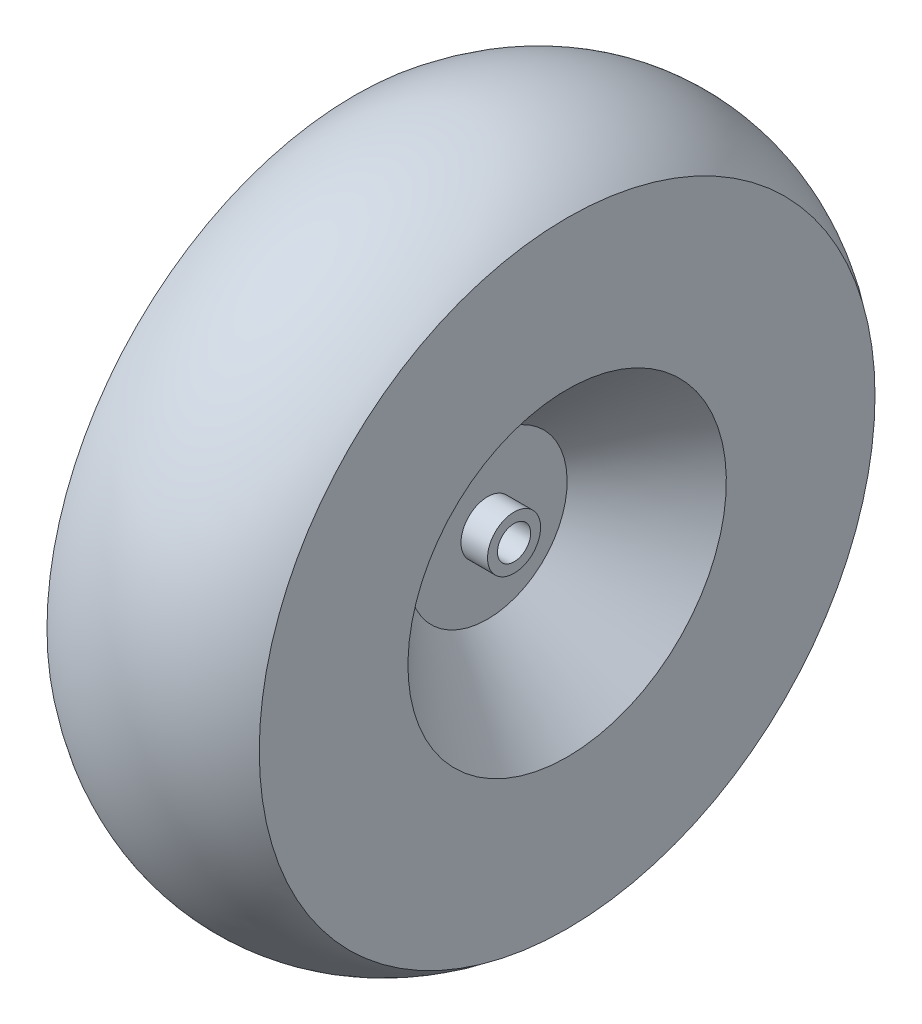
ISO-10303-21;
HEADER;
FILE_DESCRIPTION(('STEP AP214'),'2;1');
FILE_NAME('part.step','',(''),(''),'','','');
FILE_SCHEMA(('AUTOMOTIVE_DESIGN { 1 0 10303 214 1 1 1 1 }'));
ENDSEC;
DATA;
#1=APPLICATION_CONTEXT('core data for automotive mechanical design processes');
#2=APPLICATION_PROTOCOL_DEFINITION('international standard','automotive_design',2000,#1);
#3=PRODUCT_CONTEXT('',#1,'mechanical');
#4=PRODUCT('Part','Part','',(#3));
#5=PRODUCT_RELATED_PRODUCT_CATEGORY('part','',(#4));
#6=PRODUCT_DEFINITION_FORMATION('','',#4);
#7=PRODUCT_DEFINITION_CONTEXT('part definition',#1,'design');
#8=PRODUCT_DEFINITION('design','',#6,#7);
#9=PRODUCT_DEFINITION_SHAPE('','',#8);
#10=(LENGTH_UNIT() NAMED_UNIT(*) SI_UNIT(.MILLI.,.METRE.));
#11=(NAMED_UNIT(*) PLANE_ANGLE_UNIT() SI_UNIT($,.RADIAN.));
#12=(NAMED_UNIT(*) SI_UNIT($,.STERADIAN.) SOLID_ANGLE_UNIT());
#13=UNCERTAINTY_MEASURE_WITH_UNIT(LENGTH_MEASURE(1.E-05),#10,'distance_accuracy_value','');
#14=(GEOMETRIC_REPRESENTATION_CONTEXT(3) GLOBAL_UNCERTAINTY_ASSIGNED_CONTEXT((#13)) GLOBAL_UNIT_ASSIGNED_CONTEXT((#10,
#11,#12)) REPRESENTATION_CONTEXT('',''));
#15=CARTESIAN_POINT('',(0.,0.,0.));
#16=DIRECTION('',(0.,0.,1.));
#17=DIRECTION('',(1.,0.,0.));
#18=AXIS2_PLACEMENT_3D('',#15,#16,#17);
#19=CARTESIAN_POINT('',(50.8,0.,0.));
#20=DIRECTION('',(-1.,0.,0.));
#21=DIRECTION('',(0.,-1.,0.));
#22=AXIS2_PLACEMENT_3D('',#19,#20,#21);
#23=PLANE('',#22);
#24=CARTESIAN_POINT('',(50.8,0.,0.));
#25=DIRECTION('',(-1.,0.,0.));
#26=DIRECTION('',(0.,-1.,0.));
#27=AXIS2_PLACEMENT_3D('',#24,#25,#26);
#28=CIRCLE('',#27,147.358651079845);
#29=CARTESIAN_POINT('',(50.8,-147.358651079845,0.));
#30=VERTEX_POINT('',#29);
#31=EDGE_CURVE('E10',#30,#30,#28,.T.);
#32=ORIENTED_EDGE('',*,*,#31,.F.);
#33=EDGE_LOOP('',(#32));
#34=FACE_BOUND('',#33,.T.);
#35=CARTESIAN_POINT('',(50.8,0.,0.));
#36=DIRECTION('',(-1.,0.,0.));
#37=DIRECTION('',(0.,-1.,0.));
#38=AXIS2_PLACEMENT_3D('',#35,#36,#37);
#39=CIRCLE('',#38,76.2);
#40=CARTESIAN_POINT('',(50.8,-76.2,0.));
#41=VERTEX_POINT('',#40);
#42=EDGE_CURVE('E97',#41,#41,#39,.T.);
#43=ORIENTED_EDGE('',*,*,#42,.T.);
#44=EDGE_LOOP('',(#43));
#45=FACE_BOUND('',#44,.T.);
#46=ADVANCED_FACE('F46',(#34,#45),#23,.F.);
#47=CARTESIAN_POINT('',(0.,79.5701073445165,0.));
#48=DIRECTION('',(0.,0.,1.));
#49=DIRECTION('',(0.,-1.,0.));
#50=AXIS2_PLACEMENT_3D('',#47,#48,#49);
#51=ELLIPSE('',#50,85.5298926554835,83.3088481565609);
#52=TRIMMED_CURVE('',#51,(PARAMETER_VALUE(0.375513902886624)),
(PARAMETER_VALUE(5.90767140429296)),.T.,.PARAMETER.);
#53=CARTESIAN_POINT('',(-25.4,0.,0.));
#54=DIRECTION('',(-1.,0.,0.));
#55=AXIS1_PLACEMENT('',#53,#54);
#56=SURFACE_OF_REVOLUTION('',#52,#55);
#57=CARTESIAN_POINT('',(-50.8,0.,0.));
#58=DIRECTION('',(-1.,0.,0.));
#59=DIRECTION('',(0.,-1.,0.));
#60=AXIS2_PLACEMENT_3D('',#57,#58,#59);
#61=CIRCLE('',#60,147.358651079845);
#62=CARTESIAN_POINT('',(-50.7999999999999,-147.358651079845,0.));
#63=VERTEX_POINT('',#62);
#64=EDGE_CURVE('E53',#63,#63,#61,.T.);
#65=ORIENTED_EDGE('',*,*,#64,.F.);
#66=EDGE_LOOP('',(#65));
#67=FACE_BOUND('',#66,.T.);
#68=ORIENTED_EDGE('',*,*,#31,.T.);
#69=EDGE_LOOP('',(#68));
#70=FACE_BOUND('',#69,.T.);
#71=ADVANCED_FACE('F102',(#67,#70),#56,.T.);
#72=CARTESIAN_POINT('',(-50.8,0.,0.));
#73=DIRECTION('',(-1.,0.,0.));
#74=DIRECTION('',(0.,-1.,0.));
#75=AXIS2_PLACEMENT_3D('',#72,#73,#74);
#76=PLANE('',#75);
#77=ORIENTED_EDGE('',*,*,#64,.T.);
#78=EDGE_LOOP('',(#77));
#79=FACE_BOUND('',#78,.T.);
#80=CARTESIAN_POINT('',(-50.8,0.,0.));
#81=DIRECTION('',(-1.,0.,0.));
#82=DIRECTION('',(0.,-1.,0.));
#83=AXIS2_PLACEMENT_3D('',#80,#81,#82);
#84=CIRCLE('',#83,76.2);
#85=CARTESIAN_POINT('',(-50.8,-76.2,0.));
#86=VERTEX_POINT('',#85);
#87=EDGE_CURVE('E58',#86,#86,#84,.T.);
#88=ORIENTED_EDGE('',*,*,#87,.F.);
#89=EDGE_LOOP('',(#88));
#90=FACE_BOUND('',#89,.T.);
#91=ADVANCED_FACE('F105',(#79,#90),#76,.T.);
#92=CARTESIAN_POINT('',(-12.7,0.,0.));
#93=DIRECTION('',(-1.,0.,0.));
#94=DIRECTION('',(0.,-1.,0.));
#95=AXIS2_PLACEMENT_3D('',#92,#93,#94);
#96=CONICAL_SURFACE('',#95,38.0999999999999,0.78539816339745);
#97=ORIENTED_EDGE('',*,*,#87,.T.);
#98=EDGE_LOOP('',(#97));
#99=FACE_BOUND('',#98,.T.);
#100=CARTESIAN_POINT('',(-12.7,0.,0.));
#101=DIRECTION('',(-1.,0.,0.));
#102=DIRECTION('',(0.,-1.,0.));
#103=AXIS2_PLACEMENT_3D('',#100,#101,#102);
#104=CIRCLE('',#103,38.0999999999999);
#105=CARTESIAN_POINT('',(-12.7,-38.0999999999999,0.));
#106=VERTEX_POINT('',#105);
#107=EDGE_CURVE('E63',#106,#106,#104,.T.);
#108=ORIENTED_EDGE('',*,*,#107,.F.);
#109=EDGE_LOOP('',(#108));
#110=FACE_BOUND('',#109,.T.);
#111=ADVANCED_FACE('F109',(#99,#110),#96,.F.);
#112=CARTESIAN_POINT('',(-12.7,0.,0.));
#113=DIRECTION('',(-1.,0.,0.));
#114=DIRECTION('',(0.,-1.,0.));
#115=AXIS2_PLACEMENT_3D('',#112,#113,#114);
#116=PLANE('',#115);
#117=ORIENTED_EDGE('',*,*,#107,.T.);
#118=EDGE_LOOP('',(#117));
#119=FACE_BOUND('',#118,.T.);
#120=CARTESIAN_POINT('',(-12.7,0.,0.));
#121=DIRECTION('',(-1.,0.,0.));
#122=DIRECTION('',(0.,-1.,0.));
#123=AXIS2_PLACEMENT_3D('',#120,#121,#122);
#124=CIRCLE('',#123,12.7);
#125=CARTESIAN_POINT('',(-12.7,-12.7,0.));
#126=VERTEX_POINT('',#125);
#127=EDGE_CURVE('E69',#126,#126,#124,.T.);
#128=ORIENTED_EDGE('',*,*,#127,.F.);
#129=EDGE_LOOP('',(#128));
#130=FACE_BOUND('',#129,.T.);
#131=ADVANCED_FACE('F112',(#119,#130),#116,.T.);
#132=CARTESIAN_POINT('',(-25.4,0.,0.));
#133=DIRECTION('',(-1.,0.,0.));
#134=DIRECTION('',(0.,-1.,0.));
#135=AXIS2_PLACEMENT_3D('',#132,#133,#134);
#136=CYLINDRICAL_SURFACE('',#135,12.7);
#137=CARTESIAN_POINT('',(-25.4,0.,0.));
#138=DIRECTION('',(-1.,0.,0.));
#139=DIRECTION('',(0.,-1.,0.));
#140=AXIS2_PLACEMENT_3D('',#137,#138,#139);
#141=CIRCLE('',#140,12.7);
#142=CARTESIAN_POINT('',(-25.4,-12.7,0.));
#143=VERTEX_POINT('',#142);
#144=EDGE_CURVE('E73',#143,#143,#141,.T.);
#145=ORIENTED_EDGE('',*,*,#144,.F.);
#146=EDGE_LOOP('',(#145));
#147=FACE_BOUND('',#146,.T.);
#148=ORIENTED_EDGE('',*,*,#127,.T.);
#149=EDGE_LOOP('',(#148));
#150=FACE_BOUND('',#149,.T.);
#151=ADVANCED_FACE('F116',(#147,#150),#136,.T.);
#152=CARTESIAN_POINT('',(-25.4,0.,0.));
#153=DIRECTION('',(-1.,0.,0.));
#154=DIRECTION('',(0.,-1.,0.));
#155=AXIS2_PLACEMENT_3D('',#152,#153,#154);
#156=PLANE('',#155);
#157=ORIENTED_EDGE('',*,*,#144,.T.);
#158=EDGE_LOOP('',(#157));
#159=FACE_BOUND('',#158,.T.);
#160=CARTESIAN_POINT('',(-25.4,0.,0.));
#161=DIRECTION('',(-1.,0.,0.));
#162=DIRECTION('',(0.,-1.,0.));
#163=AXIS2_PLACEMENT_3D('',#160,#161,#162);
#164=CIRCLE('',#163,7.93749999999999);
#165=CARTESIAN_POINT('',(-25.4,-7.93749999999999,0.));
#166=VERTEX_POINT('',#165);
#167=EDGE_CURVE('E77',#166,#166,#164,.T.);
#168=ORIENTED_EDGE('',*,*,#167,.F.);
#169=EDGE_LOOP('',(#168));
#170=FACE_BOUND('',#169,.T.);
#171=ADVANCED_FACE('F120',(#159,#170),#156,.T.);
#172=CARTESIAN_POINT('',(-25.4,0.,0.));
#173=DIRECTION('',(-1.,0.,0.));
#174=DIRECTION('',(0.,-1.,0.));
#175=AXIS2_PLACEMENT_3D('',#172,#173,#174);
#176=CYLINDRICAL_SURFACE('',#175,7.93749999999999);
#177=ORIENTED_EDGE('',*,*,#167,.T.);
#178=EDGE_LOOP('',(#177));
#179=FACE_BOUND('',#178,.T.);
#180=CARTESIAN_POINT('',(25.4,0.,0.));
#181=DIRECTION('',(-1.,0.,0.));
#182=DIRECTION('',(0.,-1.,0.));
#183=AXIS2_PLACEMENT_3D('',#180,#181,#182);
#184=CIRCLE('',#183,7.93749999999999);
#185=CARTESIAN_POINT('',(25.4,-7.93749999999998,0.));
#186=VERTEX_POINT('',#185);
#187=EDGE_CURVE('E81',#186,#186,#184,.T.);
#188=ORIENTED_EDGE('',*,*,#187,.F.);
#189=EDGE_LOOP('',(#188));
#190=FACE_BOUND('',#189,.T.);
#191=ADVANCED_FACE('F124',(#179,#190),#176,.F.);
#192=CARTESIAN_POINT('',(25.4,0.,0.));
#193=DIRECTION('',(-1.,0.,0.));
#194=DIRECTION('',(0.,-1.,0.));
#195=AXIS2_PLACEMENT_3D('',#192,#193,#194);
#196=PLANE('',#195);
#197=CARTESIAN_POINT('',(25.4,0.,0.));
#198=DIRECTION('',(-1.,0.,0.));
#199=DIRECTION('',(0.,-1.,0.));
#200=AXIS2_PLACEMENT_3D('',#197,#198,#199);
#201=CIRCLE('',#200,12.7);
#202=CARTESIAN_POINT('',(25.4,-12.7,0.));
#203=VERTEX_POINT('',#202);
#204=EDGE_CURVE('E85',#203,#203,#201,.T.);
#205=ORIENTED_EDGE('',*,*,#204,.F.);
#206=EDGE_LOOP('',(#205));
#207=FACE_BOUND('',#206,.T.);
#208=ORIENTED_EDGE('',*,*,#187,.T.);
#209=EDGE_LOOP('',(#208));
#210=FACE_BOUND('',#209,.T.);
#211=ADVANCED_FACE('F128',(#207,#210),#196,.F.);
#212=CARTESIAN_POINT('',(-25.4,0.,0.));
#213=DIRECTION('',(-1.,0.,0.));
#214=DIRECTION('',(0.,-1.,0.));
#215=AXIS2_PLACEMENT_3D('',#212,#213,#214);
#216=CYLINDRICAL_SURFACE('',#215,12.7);
#217=ORIENTED_EDGE('',*,*,#204,.T.);
#218=EDGE_LOOP('',(#217));
#219=FACE_BOUND('',#218,.T.);
#220=CARTESIAN_POINT('',(12.7,0.,0.));
#221=DIRECTION('',(-1.,0.,0.));
#222=DIRECTION('',(0.,-1.,0.));
#223=AXIS2_PLACEMENT_3D('',#220,#221,#222);
#224=CIRCLE('',#223,12.7);
#225=CARTESIAN_POINT('',(12.7,-12.7,0.));
#226=VERTEX_POINT('',#225);
#227=EDGE_CURVE('E89',#226,#226,#224,.T.);
#228=ORIENTED_EDGE('',*,*,#227,.F.);
#229=EDGE_LOOP('',(#228));
#230=FACE_BOUND('',#229,.T.);
#231=ADVANCED_FACE('F132',(#219,#230),#216,.T.);
#232=CARTESIAN_POINT('',(12.7,0.,0.));
#233=DIRECTION('',(-1.,0.,0.));
#234=DIRECTION('',(0.,-1.,0.));
#235=AXIS2_PLACEMENT_3D('',#232,#233,#234);
#236=PLANE('',#235);
#237=CARTESIAN_POINT('',(12.7,0.,0.));
#238=DIRECTION('',(-1.,0.,0.));
#239=DIRECTION('',(0.,-1.,0.));
#240=AXIS2_PLACEMENT_3D('',#237,#238,#239);
#241=CIRCLE('',#240,38.0999999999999);
#242=CARTESIAN_POINT('',(12.7,-38.0999999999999,0.));
#243=VERTEX_POINT('',#242);
#244=EDGE_CURVE('E93',#243,#243,#241,.T.);
#245=ORIENTED_EDGE('',*,*,#244,.F.);
#246=EDGE_LOOP('',(#245));
#247=FACE_BOUND('',#246,.T.);
#248=ORIENTED_EDGE('',*,*,#227,.T.);
#249=EDGE_LOOP('',(#248));
#250=FACE_BOUND('',#249,.T.);
#251=ADVANCED_FACE('F136',(#247,#250),#236,.F.);
#252=CARTESIAN_POINT('',(12.7,0.,0.));
#253=DIRECTION('',(1.,0.,0.));
#254=DIRECTION('',(0.,1.,0.));
#255=AXIS2_PLACEMENT_3D('',#252,#253,#254);
#256=CONICAL_SURFACE('',#255,38.0999999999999,0.78539816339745);
#257=ORIENTED_EDGE('',*,*,#42,.F.);
#258=EDGE_LOOP('',(#257));
#259=FACE_BOUND('',#258,.T.);
#260=ORIENTED_EDGE('',*,*,#244,.T.);
#261=EDGE_LOOP('',(#260));
#262=FACE_BOUND('',#261,.T.);
#263=ADVANCED_FACE('F140',(#259,#262),#256,.F.);
#264=CLOSED_SHELL('',(#46,#71,#91,#111,#131,#151,#171,#191,#211,#231,#251,#263));
#265=MANIFOLD_SOLID_BREP('B2',#264);
#266=ADVANCED_BREP_SHAPE_REPRESENTATION('',(#18,#265),#14);
#267=SHAPE_DEFINITION_REPRESENTATION(#9,#266);
ENDSEC;
END-ISO-10303-21;
